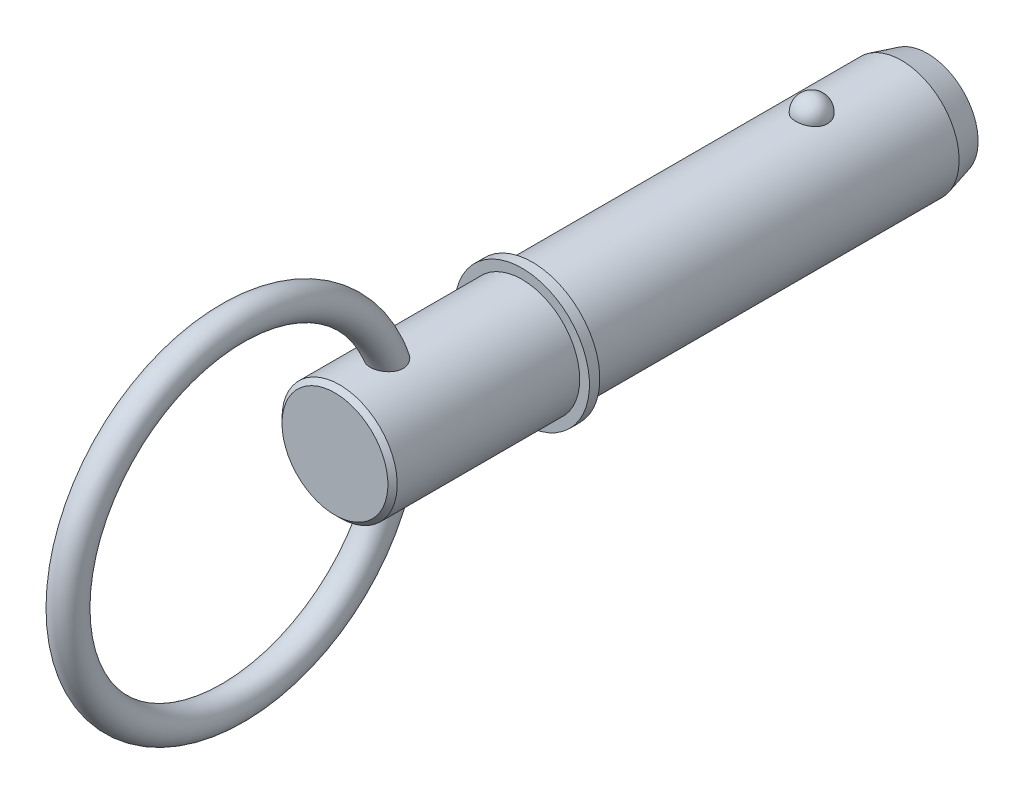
ISO-10303-21;
HEADER;
FILE_DESCRIPTION(('STEP AP214'),'2;1');
FILE_NAME('part.step','',(''),(''),'','','');
FILE_SCHEMA(('AUTOMOTIVE_DESIGN { 1 0 10303 214 1 1 1 1 }'));
ENDSEC;
DATA;
#1=APPLICATION_CONTEXT('core data for automotive mechanical design processes');
#2=APPLICATION_PROTOCOL_DEFINITION('international standard','automotive_design',2000,#1);
#3=PRODUCT_CONTEXT('',#1,'mechanical');
#4=PRODUCT('Part','Part','',(#3));
#5=PRODUCT_RELATED_PRODUCT_CATEGORY('part','',(#4));
#6=PRODUCT_DEFINITION_FORMATION('','',#4);
#7=PRODUCT_DEFINITION_CONTEXT('part definition',#1,'design');
#8=PRODUCT_DEFINITION('design','',#6,#7);
#9=PRODUCT_DEFINITION_SHAPE('','',#8);
#10=(LENGTH_UNIT() NAMED_UNIT(*) SI_UNIT(.MILLI.,.METRE.));
#11=(NAMED_UNIT(*) PLANE_ANGLE_UNIT() SI_UNIT($,.RADIAN.));
#12=(NAMED_UNIT(*) SI_UNIT($,.STERADIAN.) SOLID_ANGLE_UNIT());
#13=UNCERTAINTY_MEASURE_WITH_UNIT(LENGTH_MEASURE(1.E-05),#10,'distance_accuracy_value','');
#14=(GEOMETRIC_REPRESENTATION_CONTEXT(3) GLOBAL_UNCERTAINTY_ASSIGNED_CONTEXT((#13)) GLOBAL_UNIT_ASSIGNED_CONTEXT((#10,
#11,#12)) REPRESENTATION_CONTEXT('',''));
#15=CARTESIAN_POINT('',(0.,0.,0.));
#16=DIRECTION('',(0.,0.,1.));
#17=DIRECTION('',(1.,0.,0.));
#18=AXIS2_PLACEMENT_3D('',#15,#16,#17);
#19=CARTESIAN_POINT('',(0.,0.,50.8));
#20=DIRECTION('',(0.,0.,-1.));
#21=DIRECTION('',(-1.,0.,0.));
#22=AXIS2_PLACEMENT_3D('',#19,#20,#21);
#23=CYLINDRICAL_SURFACE('',#22,11.115);
#24=CARTESIAN_POINT('',(3.04058343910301,10.6910278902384,-3.07));
#25=CARTESIAN_POINT('',(3.04058039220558,10.6910304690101,-2.89837124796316));
#26=CARTESIAN_POINT('',(3.02657193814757,10.6950430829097,-2.72670368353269));
#27=CARTESIAN_POINT('',(2.97087341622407,10.7106465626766,-2.38822964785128));
#28=CARTESIAN_POINT('',(2.92917240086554,10.7222404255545,-2.22142512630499));
#29=CARTESIAN_POINT('',(2.81915317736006,10.751689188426,-1.89750816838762));
#30=CARTESIAN_POINT('',(2.75084669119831,10.7695413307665,-1.7403914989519));
#31=CARTESIAN_POINT('',(2.58932284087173,10.809510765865,-1.44013959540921));
#32=CARTESIAN_POINT('',(2.49610617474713,10.8316279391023,-1.29700396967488));
#33=CARTESIAN_POINT('',(2.28659317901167,10.877786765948,-1.02797591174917));
#34=CARTESIAN_POINT('',(2.17018825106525,10.9018371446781,-0.902169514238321));
#35=CARTESIAN_POINT('',(1.91759004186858,10.9490888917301,-0.672091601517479));
#36=CARTESIAN_POINT('',(1.78139672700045,10.9722902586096,-0.567820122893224));
#37=CARTESIAN_POINT('',(1.49327884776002,11.0151925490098,-0.383992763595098));
#38=CARTESIAN_POINT('',(1.34139928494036,11.034903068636,-0.304368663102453));
#39=CARTESIAN_POINT('',(1.02584823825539,11.0686948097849,-0.17173147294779));
#40=CARTESIAN_POINT('',(0.86217801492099,11.0827766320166,-0.118715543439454));
#41=CARTESIAN_POINT('',(0.530748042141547,11.1035404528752,-0.0415304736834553));
#42=CARTESIAN_POINT('',(0.363109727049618,11.1103474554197,-0.0168734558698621));
#43=CARTESIAN_POINT('',(0.0259327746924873,11.1162480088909,0.00453486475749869));
#44=CARTESIAN_POINT('',(-0.143605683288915,11.1153422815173,0.00128877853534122));
#45=CARTESIAN_POINT('',(-0.477280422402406,11.1059854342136,-0.0327676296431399));
#46=CARTESIAN_POINT('',(-0.641459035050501,11.0976393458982,-0.0631942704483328));
#47=CARTESIAN_POINT('',(-0.962236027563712,11.0744390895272,-0.150220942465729));
#48=CARTESIAN_POINT('',(-1.11883427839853,11.0595848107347,-0.206821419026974));
#49=CARTESIAN_POINT('',(-1.4210461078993,11.0248420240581,-0.34502889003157));
#50=CARTESIAN_POINT('',(-1.56659244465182,11.0049254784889,-0.426775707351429));
#51=CARTESIAN_POINT('',(-1.84189316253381,10.9622119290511,-0.612956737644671));
#52=CARTESIAN_POINT('',(-1.97164597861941,10.9394146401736,-0.717393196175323));
#53=CARTESIAN_POINT('',(-2.21432263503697,10.8929139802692,-0.948332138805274));
#54=CARTESIAN_POINT('',(-2.3268890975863,10.8692016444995,-1.07520847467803));
#55=CARTESIAN_POINT('',(-2.52940007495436,10.8238699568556,-1.34622145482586));
#56=CARTESIAN_POINT('',(-2.6193430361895,10.8022507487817,-1.49035928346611));
#57=CARTESIAN_POINT('',(-2.77523958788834,10.7632629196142,-1.79367507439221));
#58=CARTESIAN_POINT('',(-2.8409151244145,10.7459442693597,-1.95300253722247));
#59=CARTESIAN_POINT('',(-2.94519180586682,10.7178360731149,-2.28083009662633));
#60=CARTESIAN_POINT('',(-2.98379371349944,10.707046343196,-2.44932993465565));
#61=CARTESIAN_POINT('',(-3.03284665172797,10.6932559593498,-2.78998091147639));
#62=CARTESIAN_POINT('',(-3.04341313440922,10.6902233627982,-2.96211412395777));
#63=CARTESIAN_POINT('',(-3.03646037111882,10.6922002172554,-3.305762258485));
#64=CARTESIAN_POINT('',(-3.0189418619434,10.6972094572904,-3.47727719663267));
#65=CARTESIAN_POINT('',(-2.95641582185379,10.7146564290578,-3.81396465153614));
#66=CARTESIAN_POINT('',(-2.91154117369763,10.7270582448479,-3.97916375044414));
#67=CARTESIAN_POINT('',(-2.79553341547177,10.7578713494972,-4.29947360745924));
#68=CARTESIAN_POINT('',(-2.72439927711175,10.7762828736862,-4.45458397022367));
#69=CARTESIAN_POINT('',(-2.55718900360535,10.8171819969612,-4.75123550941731));
#70=CARTESIAN_POINT('',(-2.46098224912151,10.8396907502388,-4.89270014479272));
#71=CARTESIAN_POINT('',(-2.24623042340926,10.8862165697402,-5.15724095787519));
#72=CARTESIAN_POINT('',(-2.12768452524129,10.9102336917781,-5.28031645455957));
#73=CARTESIAN_POINT('',(-1.87085107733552,10.9571990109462,-5.5050961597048));
#74=CARTESIAN_POINT('',(-1.73249451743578,10.9801430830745,-5.60672245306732));
#75=CARTESIAN_POINT('',(-1.44010079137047,11.0223008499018,-5.78517789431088));
#76=CARTESIAN_POINT('',(-1.28606470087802,11.0415148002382,-5.86200874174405));
#77=CARTESIAN_POINT('',(-0.968615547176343,11.0738491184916,-5.98788441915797));
#78=CARTESIAN_POINT('',(-0.805339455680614,11.0870408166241,-6.03725610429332));
#79=CARTESIAN_POINT('',(-0.47244987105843,11.1062048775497,-6.10820004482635));
#80=CARTESIAN_POINT('',(-0.302837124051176,11.11217808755,-6.1297755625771));
#81=CARTESIAN_POINT('',(0.0345765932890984,11.1162034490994,-6.1443619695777));
#82=CARTESIAN_POINT('',(0.20235372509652,11.1143988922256,-6.13788957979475));
#83=CARTESIAN_POINT('',(0.534364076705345,11.103390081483,-6.09773981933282));
#84=CARTESIAN_POINT('',(0.698597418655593,11.094186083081,-6.06406338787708));
#85=CARTESIAN_POINT('',(1.01830314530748,11.0694136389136,-5.97063285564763));
#86=CARTESIAN_POINT('',(1.17380497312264,11.0538682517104,-5.91097318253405));
#87=CARTESIAN_POINT('',(1.472484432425,11.0180608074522,-5.76723645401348));
#88=CARTESIAN_POINT('',(1.6156613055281,10.9977984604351,-5.68315789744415));
#89=CARTESIAN_POINT('',(1.88801614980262,10.9543574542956,-5.49138807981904));
#90=CARTESIAN_POINT('',(2.01695079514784,10.9311394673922,-5.38336024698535));
#91=CARTESIAN_POINT('',(2.25501495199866,10.8845248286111,-5.14733839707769));
#92=CARTESIAN_POINT('',(2.36414099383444,10.8611281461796,-5.01934088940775));
#93=CARTESIAN_POINT('',(2.56152595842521,10.8162958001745,-4.74447932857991));
#94=CARTESIAN_POINT('',(2.64940088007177,10.7948999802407,-4.59733288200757));
#95=CARTESIAN_POINT('',(2.79961494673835,10.7569242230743,-4.29001203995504));
#96=CARTESIAN_POINT('',(2.86196390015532,10.7403424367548,-4.12984267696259));
#97=CARTESIAN_POINT('',(2.95377333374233,10.715429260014,-3.820623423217));
#98=CARTESIAN_POINT('',(2.98627018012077,10.7063495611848,-3.67252681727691));
#99=CARTESIAN_POINT('',(3.02967634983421,10.6941478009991,-3.37296350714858));
#100=CARTESIAN_POINT('',(3.04058612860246,10.6910256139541,-3.2214968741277));
#101=CARTESIAN_POINT('',(3.04058343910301,10.6910278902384,-3.07));
#102=B_SPLINE_CURVE_WITH_KNOTS('',3,(#24,#25,#26,#27,#28,#29,#30,#31,#32,#33,#34,#35,#36,#37,
#38,#39,#40,#41,#42,#43,#44,#45,#46,#47,#48,#49,#50,#51,#52,#53,#54,#55,#56,#57,#58,#59,#60,#61,
#62,#63,#64,#65,#66,#67,#68,#69,#70,#71,#72,#73,#74,#75,#76,#77,#78,#79,#80,#81,#82,#83,#84,#85,
#86,#87,#88,#89,#90,#91,#92,#93,#94,#95,#96,#97,#98,#99,#100,#101),.UNSPECIFIED.,.T.,.F.,(4,2,2,
2,2,2,2,2,2,2,2,2,2,2,2,2,2,2,2,2,2,2,2,2,2,2,2,2,2,2,2,2,2,2,2,2,2,2,4),(0.,0.514341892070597,
1.02888723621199,1.54320613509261,2.0575106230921,2.57428293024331,3.09105611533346,
3.60638589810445,4.1216606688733,4.62793159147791,5.1341551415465,5.63334381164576,
6.13254097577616,6.63456562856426,7.13663998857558,7.64804063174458,8.15947638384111,
8.6766026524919,9.19371435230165,9.70869321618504,10.223658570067,10.7361421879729,
11.2486458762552,11.7638748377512,12.2791228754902,12.7962115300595,13.3132647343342,
13.8240238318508,14.3347229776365,14.8360540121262,15.3373677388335,15.8368746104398,
16.3364121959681,16.8434736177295,17.3506237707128,17.8663484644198,18.3818748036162,
18.8358944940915,19.2899046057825),.UNSPECIFIED.);
#103=CARTESIAN_POINT('',(3.04058343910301,10.6910278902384,-3.07));
#104=VERTEX_POINT('',#103);
#105=EDGE_CURVE('E103',#104,#104,#102,.T.);
#106=ORIENTED_EDGE('',*,*,#105,.T.);
#107=EDGE_LOOP('',(#106));
#108=FACE_BOUND('',#107,.T.);
#109=CARTESIAN_POINT('',(0.,0.,-20.3999999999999));
#110=DIRECTION('',(0.,0.,-1.));
#111=DIRECTION('',(-1.,0.,0.));
#112=AXIS2_PLACEMENT_3D('',#109,#110,#111);
#113=CIRCLE('',#112,11.115);
#114=CARTESIAN_POINT('',(-11.115,0.,-20.3999999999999));
#115=VERTEX_POINT('',#114);
#116=EDGE_CURVE('E111',#115,#115,#113,.F.);
#117=ORIENTED_EDGE('',*,*,#116,.T.);
#118=EDGE_LOOP('',(#117));
#119=FACE_BOUND('',#118,.T.);
#120=CARTESIAN_POINT('',(0.,0.,50.8));
#121=DIRECTION('',(0.,0.,1.));
#122=DIRECTION('',(1.,0.,0.));
#123=AXIS2_PLACEMENT_3D('',#120,#121,#122);
#124=CIRCLE('',#123,11.115);
#125=CARTESIAN_POINT('',(11.115,0.,50.8));
#126=VERTEX_POINT('',#125);
#127=EDGE_CURVE('E109',#126,#126,#124,.T.);
#128=ORIENTED_EDGE('',*,*,#127,.F.);
#129=EDGE_LOOP('',(#128));
#130=FACE_BOUND('',#129,.T.);
#131=ADVANCED_FACE('F39',(#108,#119,#130),#23,.T.);
#132=CARTESIAN_POINT('',(0.,0.,-25.4));
#133=DIRECTION('',(0.,0.,-1.));
#134=DIRECTION('',(-1.,0.,0.));
#135=AXIS2_PLACEMENT_3D('',#132,#133,#134);
#136=PLANE('',#135);
#137=CARTESIAN_POINT('',(0.,0.,-25.4));
#138=DIRECTION('',(0.,0.,-1.));
#139=DIRECTION('',(-1.,0.,0.));
#140=AXIS2_PLACEMENT_3D('',#137,#138,#139);
#141=CIRCLE('',#140,9.77525403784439);
#142=CARTESIAN_POINT('',(-9.77525403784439,0.,-25.4));
#143=VERTEX_POINT('',#142);
#144=EDGE_CURVE('E142',#143,#143,#141,.T.);
#145=ORIENTED_EDGE('',*,*,#144,.T.);
#146=EDGE_LOOP('',(#145));
#147=FACE_BOUND('',#146,.T.);
#148=ADVANCED_FACE('F89',(#147),#136,.T.);
#149=CARTESIAN_POINT('',(0.,0.,-25.4));
#150=DIRECTION('',(0.,0.,1.));
#151=DIRECTION('',(1.,0.,0.));
#152=AXIS2_PLACEMENT_3D('',#149,#150,#151);
#153=CONICAL_SURFACE('',#152,9.77525403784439,0.261799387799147);
#154=ORIENTED_EDGE('',*,*,#116,.F.);
#155=EDGE_LOOP('',(#154));
#156=FACE_BOUND('',#155,.T.);
#157=ORIENTED_EDGE('',*,*,#144,.F.);
#158=EDGE_LOOP('',(#157));
#159=FACE_BOUND('',#158,.T.);
#160=ADVANCED_FACE('F95',(#156,#159),#153,.T.);
#161=CARTESIAN_POINT('',(0.,11.115,-3.07));
#162=DIRECTION('',(0.,1.,0.));
#163=DIRECTION('',(0.,0.,1.));
#164=AXIS2_PLACEMENT_3D('',#161,#162,#163);
#165=SPHERICAL_SURFACE('',#164,3.07);
#166=ORIENTED_EDGE('',*,*,#105,.F.);
#167=EDGE_LOOP('',(#166));
#168=FACE_BOUND('',#167,.T.);
#169=ADVANCED_FACE('F114',(#168),#165,.T.);
#170=CARTESIAN_POINT('',(0.,0.,50.8));
#171=DIRECTION('',(0.,0.,-1.));
#172=DIRECTION('',(-1.,0.,0.));
#173=AXIS2_PLACEMENT_3D('',#170,#171,#172);
#174=PLANE('',#173);
#175=ORIENTED_EDGE('',*,*,#127,.T.);
#176=EDGE_LOOP('',(#175));
#177=FACE_BOUND('',#176,.T.);
#178=CARTESIAN_POINT('',(0.,0.,50.8));
#179=DIRECTION('',(0.,0.,-1.));
#180=DIRECTION('',(-1.,0.,0.));
#181=AXIS2_PLACEMENT_3D('',#178,#179,#180);
#182=CIRCLE('',#181,13.);
#183=CARTESIAN_POINT('',(-13.,0.,50.8));
#184=VERTEX_POINT('',#183);
#185=EDGE_CURVE('E110',#184,#184,#182,.T.);
#186=ORIENTED_EDGE('',*,*,#185,.T.);
#187=EDGE_LOOP('',(#186));
#188=FACE_BOUND('',#187,.T.);
#189=ADVANCED_FACE('F118',(#177,#188),#174,.T.);
#190=CARTESIAN_POINT('',(0.,0.,33.7287874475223));
#191=DIRECTION('',(0.,0.,-1.));
#192=DIRECTION('',(-1.,0.,0.));
#193=AXIS2_PLACEMENT_3D('',#190,#191,#192);
#194=CYLINDRICAL_SURFACE('',#193,13.);
#195=CARTESIAN_POINT('',(0.,0.,52.8));
#196=DIRECTION('',(0.,0.,-1.));
#197=DIRECTION('',(-1.,0.,0.));
#198=AXIS2_PLACEMENT_3D('',#195,#196,#197);
#199=CIRCLE('',#198,13.);
#200=CARTESIAN_POINT('',(-13.,0.,52.8));
#201=VERTEX_POINT('',#200);
#202=EDGE_CURVE('E135',#201,#201,#199,.T.);
#203=ORIENTED_EDGE('',*,*,#202,.T.);
#204=EDGE_LOOP('',(#203));
#205=FACE_BOUND('',#204,.T.);
#206=ORIENTED_EDGE('',*,*,#185,.F.);
#207=EDGE_LOOP('',(#206));
#208=FACE_BOUND('',#207,.T.);
#209=ADVANCED_FACE('F122',(#205,#208),#194,.T.);
#210=CARTESIAN_POINT('',(0.,13.,52.8));
#211=DIRECTION('',(0.,0.,1.));
#212=DIRECTION('',(1.,0.,0.));
#213=AXIS2_PLACEMENT_3D('',#210,#211,#212);
#214=PLANE('',#213);
#215=CARTESIAN_POINT('',(0.,0.,52.8));
#216=DIRECTION('',(0.,0.,1.));
#217=DIRECTION('',(1.,0.,0.));
#218=AXIS2_PLACEMENT_3D('',#215,#216,#217);
#219=CIRCLE('',#218,11.115);
#220=CARTESIAN_POINT('',(11.115,0.,52.8));
#221=VERTEX_POINT('',#220);
#222=EDGE_CURVE('E113',#221,#221,#219,.T.);
#223=ORIENTED_EDGE('',*,*,#222,.F.);
#224=EDGE_LOOP('',(#223));
#225=FACE_BOUND('',#224,.T.);
#226=ORIENTED_EDGE('',*,*,#202,.F.);
#227=EDGE_LOOP('',(#226));
#228=FACE_BOUND('',#227,.T.);
#229=ADVANCED_FACE('F86',(#225,#228),#214,.T.);
#230=CARTESIAN_POINT('',(0.,0.,88.9));
#231=DIRECTION('',(0.,0.,-1.));
#232=DIRECTION('',(-1.,0.,0.));
#233=AXIS2_PLACEMENT_3D('',#230,#231,#232);
#234=CYLINDRICAL_SURFACE('',#233,11.115);
#235=CARTESIAN_POINT('',(-1.22435852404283,-11.0473603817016,75.9784197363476));
#236=CARTESIAN_POINT('',(-1.07078016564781,-11.0643805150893,75.9116991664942));
#237=CARTESIAN_POINT('',(-0.911372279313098,-11.0787777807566,75.8577454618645));
#238=CARTESIAN_POINT('',(-0.585451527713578,-11.1007717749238,75.7765522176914));
#239=CARTESIAN_POINT('',(-0.418938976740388,-11.1083688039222,75.7493114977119));
#240=CARTESIAN_POINT('',(-0.0835394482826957,-11.1159515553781,75.7221212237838));
#241=CARTESIAN_POINT('',(0.085347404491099,-11.1159376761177,75.7221702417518));
#242=CARTESIAN_POINT('',(0.420723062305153,-11.1083011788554,75.7495547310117));
#243=CARTESIAN_POINT('',(0.587211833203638,-11.1006784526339,75.7768905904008));
#244=CARTESIAN_POINT('',(0.91318995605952,-11.0786293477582,75.8582995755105));
#245=CARTESIAN_POINT('',(1.07267378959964,-11.0641977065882,75.9123933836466));
#246=CARTESIAN_POINT('',(1.37994044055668,-11.0300907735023,76.0461408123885));
#247=CARTESIAN_POINT('',(1.52772335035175,-11.0104155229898,76.1257942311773));
#248=CARTESIAN_POINT('',(1.80679367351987,-10.9680716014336,76.3084678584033));
#249=CARTESIAN_POINT('',(1.93814041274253,-10.945414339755,76.4114000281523));
#250=CARTESIAN_POINT('',(2.18117403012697,-10.8995884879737,76.638212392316));
#251=CARTESIAN_POINT('',(2.29286356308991,-10.8764199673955,76.7620897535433));
#252=CARTESIAN_POINT('',(2.49238969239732,-10.8324319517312,77.0259926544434));
#253=CARTESIAN_POINT('',(2.58046870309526,-10.8115899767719,77.1658312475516));
#254=CARTESIAN_POINT('',(2.73218762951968,-10.7742522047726,77.4586913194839));
#255=CARTESIAN_POINT('',(2.7958294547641,-10.757756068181,77.6117117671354));
#256=CARTESIAN_POINT('',(2.89767977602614,-10.7307723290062,77.9266092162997));
#257=CARTESIAN_POINT('',(2.93586554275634,-10.7202900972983,78.0884939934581));
#258=CARTESIAN_POINT('',(2.98678800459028,-10.7062139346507,78.4164805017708));
#259=CARTESIAN_POINT('',(2.99951894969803,-10.7026215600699,78.5825831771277));
#260=CARTESIAN_POINT('',(3.0004780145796,-10.7023530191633,78.9232270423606));
#261=CARTESIAN_POINT('',(2.98743421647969,-10.7060358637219,79.0977701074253));
#262=CARTESIAN_POINT('',(2.93592917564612,-10.7202719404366,79.4427508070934));
#263=CARTESIAN_POINT('',(2.8974582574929,-10.7308277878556,79.6131868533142));
#264=CARTESIAN_POINT('',(2.79180512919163,-10.7588257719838,79.9631149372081));
#265=CARTESIAN_POINT('',(2.72213928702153,-10.776850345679,80.1418115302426));
#266=CARTESIAN_POINT('',(2.55612841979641,-10.8174264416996,80.4859744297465));
#267=CARTESIAN_POINT('',(2.45975697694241,-10.8399824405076,80.6514274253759));
#268=CARTESIAN_POINT('',(2.23434632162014,-10.8887625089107,80.975672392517));
#269=CARTESIAN_POINT('',(2.10349593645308,-10.9151327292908,81.1331925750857));
#270=CARTESIAN_POINT('',(1.81505097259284,-10.96677510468,81.4216682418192));
#271=CARTESIAN_POINT('',(1.65749731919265,-10.9920488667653,81.5526637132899));
#272=CARTESIAN_POINT('',(1.36197799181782,-11.0319737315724,81.7513134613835));
#273=CARTESIAN_POINT('',(1.22927684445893,-11.0476896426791,81.8266009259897));
#274=CARTESIAN_POINT('',(0.952979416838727,-11.0749380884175,81.9545744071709));
#275=CARTESIAN_POINT('',(0.809393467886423,-11.0864745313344,82.0072815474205));
#276=CARTESIAN_POINT('',(0.513954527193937,-11.1041011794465,82.0870588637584));
#277=CARTESIAN_POINT('',(0.362058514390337,-11.1101594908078,82.1139789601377));
#278=CARTESIAN_POINT('',(0.0557792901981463,-11.1159132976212,82.1395595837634));
#279=CARTESIAN_POINT('',(-0.0986030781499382,-11.1156109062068,82.1382294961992));
#280=CARTESIAN_POINT('',(-0.389768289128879,-11.1090283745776,82.1089352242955));
#281=CARTESIAN_POINT('',(-0.526830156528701,-11.1033186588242,82.0835124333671));
#282=CARTESIAN_POINT('',(-0.794878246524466,-11.0873547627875,82.0112701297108));
#283=CARTESIAN_POINT('',(-0.925863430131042,-11.0770998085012,81.9644469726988));
#284=CARTESIAN_POINT('',(-1.18354406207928,-11.0525934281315,81.8498438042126));
#285=CARTESIAN_POINT('',(-1.30991621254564,-11.0382116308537,81.7813711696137));
#286=CARTESIAN_POINT('',(-1.55122352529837,-11.0068962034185,81.6271312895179));
#287=CARTESIAN_POINT('',(-1.66615377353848,-10.9899614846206,81.5413566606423));
#288=CARTESIAN_POINT('',(-1.90024050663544,-10.9520991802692,81.3408720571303));
#289=CARTESIAN_POINT('',(-2.01728342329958,-10.9309598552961,81.2237372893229));
#290=CARTESIAN_POINT('',(-2.23333659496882,-10.8888735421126,80.9738397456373));
#291=CARTESIAN_POINT('',(-2.33233396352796,-10.8679267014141,80.8410659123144));
#292=CARTESIAN_POINT('',(-2.52607041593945,-10.8246766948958,80.5400006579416));
#293=CARTESIAN_POINT('',(-2.61741570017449,-10.8027194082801,80.3694627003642));
#294=CARTESIAN_POINT('',(-2.77251687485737,-10.7639568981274,80.0156715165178));
#295=CARTESIAN_POINT('',(-2.8362578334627,-10.7471544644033,79.8324114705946));
#296=CARTESIAN_POINT('',(-2.93668505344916,-10.7201706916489,79.4466242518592));
#297=CARTESIAN_POINT('',(-2.97161961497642,-10.7104219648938,79.243594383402));
#298=CARTESIAN_POINT('',(-2.99683495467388,-10.7033740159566,78.9368749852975));
#299=CARTESIAN_POINT('',(-3.00070536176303,-10.7022882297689,78.8342341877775));
#300=CARTESIAN_POINT('',(-2.99908594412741,-10.7027439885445,78.6290499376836));
#301=CARTESIAN_POINT('',(-2.99360154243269,-10.7042840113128,78.5265064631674));
#302=CARTESIAN_POINT('',(-2.97382504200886,-10.7097936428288,78.330330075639));
#303=CARTESIAN_POINT('',(-2.9602439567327,-10.7135669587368,78.2366192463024));
#304=CARTESIAN_POINT('',(-2.92480741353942,-10.723295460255,78.050932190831));
#305=CARTESIAN_POINT('',(-2.90295619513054,-10.7292495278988,77.9589551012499));
#306=CARTESIAN_POINT('',(-2.8509700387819,-10.7431800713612,77.7775474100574));
#307=CARTESIAN_POINT('',(-2.82083748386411,-10.7511559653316,77.6881160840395));
#308=CARTESIAN_POINT('',(-2.75241691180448,-10.7688750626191,77.5126453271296));
#309=CARTESIAN_POINT('',(-2.71412954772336,-10.7786181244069,77.4266056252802));
#310=CARTESIAN_POINT('',(-2.59550576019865,-10.807996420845,77.1910554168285));
#311=CARTESIAN_POINT('',(-2.50612224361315,-10.8292837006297,77.0461731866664));
#312=CARTESIAN_POINT('',(-2.30366035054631,-10.8741467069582,76.7745713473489));
#313=CARTESIAN_POINT('',(-2.19058370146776,-10.8977222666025,76.6478504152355));
#314=CARTESIAN_POINT('',(-1.94442412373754,-10.9443154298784,76.4164621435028));
#315=CARTESIAN_POINT('',(-1.81141354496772,-10.967334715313,76.3117182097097));
#316=CARTESIAN_POINT('',(-1.529042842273,-11.0102504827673,76.1264358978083));
#317=CARTESIAN_POINT('',(-1.37968206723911,-11.0301468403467,76.0458984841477));
#318=CARTESIAN_POINT('',(-1.22435852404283,-11.0473603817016,75.9784197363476));
#319=B_SPLINE_CURVE_WITH_KNOTS('',3,(#235,#236,#237,#238,#239,#240,#241,#242,#243,#244,#245,
#246,#247,#248,#249,#250,#251,#252,#253,#254,#255,#256,#257,#258,#259,#260,#261,#262,#263,#264,
#265,#266,#267,#268,#269,#270,#271,#272,#273,#274,#275,#276,#277,#278,#279,#280,#281,#282,#283,
#284,#285,#286,#287,#288,#289,#290,#291,#292,#293,#294,#295,#296,#297,#298,#299,#300,#301,#302,
#303,#304,#305,#306,#307,#308,#309,#310,#311,#312,#313,#314,#315,#316,#317,#318),.UNSPECIFIED.,
.T.,.F.,(4,2,2,2,2,2,2,2,2,2,2,2,2,2,2,2,2,2,2,2,2,2,2,2,2,2,2,2,2,2,2,2,2,2,2,2,2,2,2,2,2,4),
(0.,0.504317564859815,1.00861284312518,1.51288173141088,2.01715779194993,2.52182424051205,
3.02648670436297,3.52927157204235,4.03198848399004,4.52932690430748,5.02662645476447,
5.5243694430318,6.0222248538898,6.545261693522,7.06849767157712,7.64398785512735,
8.22004937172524,8.83633461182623,9.45168373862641,9.90997173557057,10.3678300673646,
10.8283372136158,11.2886913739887,11.7053264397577,12.1220324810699,12.5537129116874,
12.9855779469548,13.4844842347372,13.9837454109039,14.5653303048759,15.1472294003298,
15.762338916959,16.0701226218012,16.3777279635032,16.6616380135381,16.9454027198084,
17.229085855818,17.5127462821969,18.0246262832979,18.5364689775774,19.0464970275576,
19.5565453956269),.UNSPECIFIED.);
#320=CARTESIAN_POINT('',(-1.22435852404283,-11.0473603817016,75.9784197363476));
#321=VERTEX_POINT('',#320);
#322=EDGE_CURVE('E10',#321,#321,#319,.T.);
#323=ORIENTED_EDGE('',*,*,#322,.F.);
#324=EDGE_LOOP('',(#323));
#325=FACE_BOUND('',#324,.T.);
#326=CARTESIAN_POINT('',(-1.22435852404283,11.0473603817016,75.9784197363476));
#327=CARTESIAN_POINT('',(-1.37630771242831,11.0305212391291,76.044431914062));
#328=CARTESIAN_POINT('',(-1.52254325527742,11.0111158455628,76.1229381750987));
#329=CARTESIAN_POINT('',(-1.79945383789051,10.9692671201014,76.3031533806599));
#330=CARTESIAN_POINT('',(-1.93013010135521,10.9468240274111,76.4048604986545));
#331=CARTESIAN_POINT('',(-2.17227655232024,10.9013603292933,76.6290359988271));
#332=CARTESIAN_POINT('',(-2.28373752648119,10.8783394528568,76.7515142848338));
#333=CARTESIAN_POINT('',(-2.4842745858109,10.8343057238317,77.0138954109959));
#334=CARTESIAN_POINT('',(-2.57335330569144,10.8132926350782,77.1537961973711));
#335=CARTESIAN_POINT('',(-2.7264007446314,10.7757209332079,77.4459648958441));
#336=CARTESIAN_POINT('',(-2.79054231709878,10.7591319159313,77.5981385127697));
#337=CARTESIAN_POINT('',(-2.89354234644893,10.7318913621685,77.9112862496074));
#338=CARTESIAN_POINT('',(-2.93239912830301,10.7212402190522,78.0722609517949));
#339=CARTESIAN_POINT('',(-2.98540436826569,10.7066038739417,78.4019559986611));
#340=CARTESIAN_POINT('',(-2.9990165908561,10.7027634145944,78.5707680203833));
#341=CARTESIAN_POINT('',(-3.0008814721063,10.7022388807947,78.9085087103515));
#342=CARTESIAN_POINT('',(-2.98912652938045,10.7055569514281,79.0774373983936));
#343=CARTESIAN_POINT('',(-2.93985175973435,10.7191979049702,79.4248560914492));
#344=CARTESIAN_POINT('',(-2.90036626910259,10.7300544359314,79.6030445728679));
#345=CARTESIAN_POINT('',(-2.7955500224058,10.7578360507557,79.9512150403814));
#346=CARTESIAN_POINT('',(-2.73019988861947,10.774765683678,80.1211907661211));
#347=CARTESIAN_POINT('',(-2.56762574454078,10.8147227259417,80.4657841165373));
#348=CARTESIAN_POINT('',(-2.46786230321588,10.838191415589,80.6391574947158));
#349=CARTESIAN_POINT('',(-2.24100420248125,10.8873575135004,80.9666868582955));
#350=CARTESIAN_POINT('',(-2.11391925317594,10.9130541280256,81.1208496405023));
#351=CARTESIAN_POINT('',(-1.85542700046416,10.9597063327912,81.3827355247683));
#352=CARTESIAN_POINT('',(-1.72758345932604,10.9807909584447,81.4939559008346));
#353=CARTESIAN_POINT('',(-1.45489931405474,11.0202250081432,81.6941223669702));
#354=CARTESIAN_POINT('',(-1.31006770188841,11.0385758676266,81.7830801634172));
#355=CARTESIAN_POINT('',(-1.08171164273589,11.0625084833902,81.8963702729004));
#356=CARTESIAN_POINT('',(-1.00332234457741,11.069914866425,81.9308967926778));
#357=CARTESIAN_POINT('',(-0.843525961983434,11.0832350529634,81.9923914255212));
#358=CARTESIAN_POINT('',(-0.762120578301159,11.0891496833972,82.0193637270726));
#359=CARTESIAN_POINT('',(-0.5970144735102,11.0992628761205,82.0651819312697));
#360=CARTESIAN_POINT('',(-0.513315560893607,11.1034627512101,82.0840340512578));
#361=CARTESIAN_POINT('',(-0.344374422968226,11.1099851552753,82.1132096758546));
#362=CARTESIAN_POINT('',(-0.259132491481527,11.1123080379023,82.1235347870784));
#363=CARTESIAN_POINT('',(-0.100838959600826,11.114780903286,82.1345196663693));
#364=CARTESIAN_POINT('',(-0.0278735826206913,11.1152042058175,82.136395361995));
#365=CARTESIAN_POINT('',(0.117962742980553,11.1146132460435,82.1337734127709));
#366=CARTESIAN_POINT('',(0.190833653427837,11.1135985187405,82.1292737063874));
#367=CARTESIAN_POINT('',(0.335842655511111,11.110161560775,82.1139786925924));
#368=CARTESIAN_POINT('',(0.407981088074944,11.1077400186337,82.1031864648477));
#369=CARTESIAN_POINT('',(0.551029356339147,11.1015643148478,82.075503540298));
#370=CARTESIAN_POINT('',(0.621938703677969,11.0978096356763,82.0586104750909));
#371=CARTESIAN_POINT('',(0.825381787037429,11.0851145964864,82.0010547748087));
#372=CARTESIAN_POINT('',(0.955713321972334,11.0745538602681,81.9527059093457));
#373=CARTESIAN_POINT('',(1.20733127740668,11.0499605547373,81.8373252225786));
#374=CARTESIAN_POINT('',(1.328615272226,11.0359270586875,81.7702884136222));
#375=CARTESIAN_POINT('',(1.57344360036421,11.0038352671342,81.6118439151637));
#376=CARTESIAN_POINT('',(1.69572941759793,10.9855025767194,81.5185512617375));
#377=CARTESIAN_POINT('',(1.92565215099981,10.9475431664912,81.3156505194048));
#378=CARTESIAN_POINT('',(2.03328016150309,10.9279156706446,81.2060325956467));
#379=CARTESIAN_POINT('',(2.25048911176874,10.8854412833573,80.9529911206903));
#380=CARTESIAN_POINT('',(2.35710396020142,10.8626332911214,80.8070101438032));
#381=CARTESIAN_POINT('',(2.54757318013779,10.8195493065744,80.500478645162));
#382=CARTESIAN_POINT('',(2.63141052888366,10.799275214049,80.3399173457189));
#383=CARTESIAN_POINT('',(2.78342312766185,10.7611645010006,79.9878272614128));
#384=CARTESIAN_POINT('',(2.84851472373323,10.7439117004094,79.7948938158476));
#385=CARTESIAN_POINT('',(2.9456265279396,10.7177011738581,79.4001309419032));
#386=CARTESIAN_POINT('',(2.97764942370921,10.7087427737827,79.1983022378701));
#387=CARTESIAN_POINT('',(2.99864828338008,10.7028651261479,78.8959897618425));
#388=CARTESIAN_POINT('',(3.00125529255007,10.7021342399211,78.7963789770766));
#389=CARTESIAN_POINT('',(2.9976304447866,10.7031517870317,78.5973450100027));
#390=CARTESIAN_POINT('',(2.99140295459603,10.704898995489,78.4979217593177));
#391=CARTESIAN_POINT('',(2.96990080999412,10.710883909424,78.3001790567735));
#392=CARTESIAN_POINT('',(2.95463019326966,10.7151205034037,78.2018591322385));
#393=CARTESIAN_POINT('',(2.91493260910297,10.7259879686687,78.0072196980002));
#394=CARTESIAN_POINT('',(2.89050674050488,10.7326185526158,77.9108999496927));
#395=CARTESIAN_POINT('',(2.83556656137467,10.7472556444,77.7312221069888));
#396=CARTESIAN_POINT('',(2.8059633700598,10.7550439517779,77.6475666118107));
#397=CARTESIAN_POINT('',(2.73953102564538,10.7721572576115,77.4833000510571));
#398=CARTESIAN_POINT('',(2.70269935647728,10.7814827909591,77.4026900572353));
#399=CARTESIAN_POINT('',(2.62203440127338,10.801383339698,77.2452733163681));
#400=CARTESIAN_POINT('',(2.57820565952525,10.8119575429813,77.1684641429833));
#401=CARTESIAN_POINT('',(2.48382482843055,10.8340293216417,77.0192237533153));
#402=CARTESIAN_POINT('',(2.43327032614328,10.8455272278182,76.9467941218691));
#403=CARTESIAN_POINT('',(2.27895739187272,10.879345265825,76.7459926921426));
#404=CARTESIAN_POINT('',(2.1671718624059,10.9023791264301,76.6237643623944));
#405=CARTESIAN_POINT('',(1.92442677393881,10.9478318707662,76.4001515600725));
#406=CARTESIAN_POINT('',(1.79346836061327,10.9702507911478,76.298765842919));
#407=CARTESIAN_POINT('',(1.51657151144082,11.0119360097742,76.1195646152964));
#408=CARTESIAN_POINT('',(1.37069187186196,11.0312139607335,76.0416610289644));
#409=CARTESIAN_POINT('',(1.06764402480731,11.0646548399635,75.9106801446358));
#410=CARTESIAN_POINT('',(0.910475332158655,11.0788175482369,75.8576039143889));
#411=CARTESIAN_POINT('',(0.587492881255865,11.1006548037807,75.77697871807));
#412=CARTESIAN_POINT('',(0.421604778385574,11.1082585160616,75.7497081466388));
#413=CARTESIAN_POINT('',(0.0874262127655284,11.1159127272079,75.7222592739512));
#414=CARTESIAN_POINT('',(-0.0808643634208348,11.1159628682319,75.7220822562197));
#415=CARTESIAN_POINT('',(-0.416252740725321,11.1084780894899,75.7489180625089));
#416=CARTESIAN_POINT('',(-0.583334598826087,11.1008914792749,75.776116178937));
#417=CARTESIAN_POINT('',(-0.910355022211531,11.0788693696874,75.8574015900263));
#418=CARTESIAN_POINT('',(-1.07029370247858,11.064433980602,75.9114884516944));
#419=CARTESIAN_POINT('',(-1.22435852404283,11.0473603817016,75.9784197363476));
#420=B_SPLINE_CURVE_WITH_KNOTS('',3,(#326,#327,#328,#329,#330,#331,#332,#333,#334,#335,#336,
#337,#338,#339,#340,#341,#342,#343,#344,#345,#346,#347,#348,#349,#350,#351,#352,#353,#354,#355,
#356,#357,#358,#359,#360,#361,#362,#363,#364,#365,#366,#367,#368,#369,#370,#371,#372,#373,#374,
#375,#376,#377,#378,#379,#380,#381,#382,#383,#384,#385,#386,#387,#388,#389,#390,#391,#392,#393,
#394,#395,#396,#397,#398,#399,#400,#401,#402,#403,#404,#405,#406,#407,#408,#409,#410,#411,#412,
#413,#414,#415,#416,#417,#418,#419),.UNSPECIFIED.,.T.,.F.,(4,2,2,2,2,2,2,2,2,2,2,2,2,2,2,2,2,2,
2,2,2,2,2,2,2,2,2,2,2,2,2,2,2,2,2,2,2,2,2,2,2,2,2,2,2,2,4),(0.,0.498977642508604,
0.997916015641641,1.49709295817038,1.99621111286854,2.49180514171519,2.98743199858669,
3.49347125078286,3.99966216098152,4.54591839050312,5.09258465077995,5.69407889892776,
6.29535972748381,6.80565832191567,7.31568801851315,7.57328514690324,7.83073916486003,
8.08799570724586,8.34520376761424,8.5638916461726,8.78265025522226,9.00130188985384,
9.22003849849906,9.63638938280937,10.0528514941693,10.5157946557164,10.9790178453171,
11.5234572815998,12.0683024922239,12.6784825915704,13.288613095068,13.5872082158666,
13.8856557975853,14.1839702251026,14.482248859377,14.7491407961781,15.016125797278,
15.2829381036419,15.5498463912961,16.0489312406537,16.5479862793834,17.0451454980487,
17.542326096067,18.0448111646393,18.5473200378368,19.0532532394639,19.5591782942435),.UNSPECIFIED.);
#421=CARTESIAN_POINT('',(-1.22435852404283,11.0473603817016,75.9784197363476));
#422=VERTEX_POINT('',#421);
#423=EDGE_CURVE('E51',#422,#422,#420,.T.);
#424=ORIENTED_EDGE('',*,*,#423,.F.);
#425=EDGE_LOOP('',(#424));
#426=FACE_BOUND('',#425,.T.);
#427=CARTESIAN_POINT('',(0.,0.,88.));
#428=DIRECTION('',(0.,0.,-1.));
#429=DIRECTION('',(-1.,0.,0.));
#430=AXIS2_PLACEMENT_3D('',#427,#428,#429);
#431=CIRCLE('',#430,11.115);
#432=CARTESIAN_POINT('',(-11.115,0.,88.));
#433=VERTEX_POINT('',#432);
#434=EDGE_CURVE('E65',#433,#433,#431,.T.);
#435=ORIENTED_EDGE('',*,*,#434,.T.);
#436=EDGE_LOOP('',(#435));
#437=FACE_BOUND('',#436,.T.);
#438=ORIENTED_EDGE('',*,*,#222,.T.);
#439=EDGE_LOOP('',(#438));
#440=FACE_BOUND('',#439,.T.);
#441=ADVANCED_FACE('F70',(#325,#426,#437,#440),#234,.T.);
#442=CARTESIAN_POINT('',(0.,0.,88.9));
#443=DIRECTION('',(0.,0.,-1.));
#444=DIRECTION('',(-1.,0.,0.));
#445=AXIS2_PLACEMENT_3D('',#442,#443,#444);
#446=PLANE('',#445);
#447=CARTESIAN_POINT('',(0.,0.,88.9));
#448=DIRECTION('',(0.,0.,-1.));
#449=DIRECTION('',(-1.,0.,0.));
#450=AXIS2_PLACEMENT_3D('',#447,#448,#449);
#451=CIRCLE('',#450,10.215);
#452=CARTESIAN_POINT('',(-10.215,0.,88.9));
#453=VERTEX_POINT('',#452);
#454=EDGE_CURVE('E58',#453,#453,#451,.F.);
#455=ORIENTED_EDGE('',*,*,#454,.T.);
#456=EDGE_LOOP('',(#455));
#457=FACE_BOUND('',#456,.T.);
#458=ADVANCED_FACE('F77',(#457),#446,.F.);
#459=CARTESIAN_POINT('',(0.,0.,88.));
#460=DIRECTION('',(0.,0.,-1.));
#461=DIRECTION('',(-1.,0.,0.));
#462=AXIS2_PLACEMENT_3D('',#459,#460,#461);
#463=CONICAL_SURFACE('',#462,11.115,0.785398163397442);
#464=CARTESIAN_POINT('',(-10.215,0.,88.9));
#465=CARTESIAN_POINT('',(-10.224375,0.,88.890625));
#466=CARTESIAN_POINT('',(-10.23375,0.,88.88125));
#467=CARTESIAN_POINT('',(-10.2525,0.,88.8625));
#468=CARTESIAN_POINT('',(-10.261875,0.,88.853125));
#469=CARTESIAN_POINT('',(-10.280625,0.,88.834375));
#470=CARTESIAN_POINT('',(-10.29,0.,88.825));
#471=CARTESIAN_POINT('',(-10.30875,0.,88.80625));
#472=CARTESIAN_POINT('',(-10.318125,0.,88.796875));
#473=CARTESIAN_POINT('',(-10.336875,0.,88.778125));
#474=CARTESIAN_POINT('',(-10.34625,0.,88.76875));
#475=CARTESIAN_POINT('',(-10.365,0.,88.75));
#476=CARTESIAN_POINT('',(-10.374375,0.,88.740625));
#477=CARTESIAN_POINT('',(-10.393125,0.,88.721875));
#478=CARTESIAN_POINT('',(-10.4025,0.,88.7125));
#479=CARTESIAN_POINT('',(-10.42125,0.,88.69375));
#480=CARTESIAN_POINT('',(-10.430625,0.,88.684375));
#481=CARTESIAN_POINT('',(-10.449375,0.,88.665625));
#482=CARTESIAN_POINT('',(-10.45875,0.,88.65625));
#483=CARTESIAN_POINT('',(-10.4775,0.,88.6375));
#484=CARTESIAN_POINT('',(-10.486875,0.,88.628125));
#485=CARTESIAN_POINT('',(-10.505625,0.,88.609375));
#486=CARTESIAN_POINT('',(-10.515,0.,88.6));
#487=CARTESIAN_POINT('',(-10.53375,0.,88.58125));
#488=CARTESIAN_POINT('',(-10.543125,0.,88.571875));
#489=CARTESIAN_POINT('',(-10.561875,0.,88.553125));
#490=CARTESIAN_POINT('',(-10.57125,0.,88.54375));
#491=CARTESIAN_POINT('',(-10.59,0.,88.525));
#492=CARTESIAN_POINT('',(-10.599375,0.,88.515625));
#493=CARTESIAN_POINT('',(-10.618125,0.,88.496875));
#494=CARTESIAN_POINT('',(-10.6275,0.,88.4875));
#495=CARTESIAN_POINT('',(-10.64625,0.,88.46875));
#496=CARTESIAN_POINT('',(-10.655625,0.,88.459375));
#497=CARTESIAN_POINT('',(-10.674375,0.,88.440625));
#498=CARTESIAN_POINT('',(-10.68375,0.,88.43125));
#499=CARTESIAN_POINT('',(-10.7025,0.,88.4125));
#500=CARTESIAN_POINT('',(-10.711875,0.,88.403125));
#501=CARTESIAN_POINT('',(-10.730625,0.,88.384375));
#502=CARTESIAN_POINT('',(-10.74,0.,88.375));
#503=CARTESIAN_POINT('',(-10.75875,0.,88.35625));
#504=CARTESIAN_POINT('',(-10.768125,0.,88.346875));
#505=CARTESIAN_POINT('',(-10.786875,0.,88.328125));
#506=CARTESIAN_POINT('',(-10.79625,0.,88.31875));
#507=CARTESIAN_POINT('',(-10.815,0.,88.3));
#508=CARTESIAN_POINT('',(-10.824375,0.,88.290625));
#509=CARTESIAN_POINT('',(-10.843125,0.,88.271875));
#510=CARTESIAN_POINT('',(-10.8525,0.,88.2625));
#511=CARTESIAN_POINT('',(-10.87125,0.,88.24375));
#512=CARTESIAN_POINT('',(-10.880625,0.,88.234375));
#513=CARTESIAN_POINT('',(-10.899375,0.,88.215625));
#514=CARTESIAN_POINT('',(-10.90875,0.,88.20625));
#515=CARTESIAN_POINT('',(-10.9275,0.,88.1875));
#516=CARTESIAN_POINT('',(-10.936875,0.,88.178125));
#517=CARTESIAN_POINT('',(-10.955625,0.,88.159375));
#518=CARTESIAN_POINT('',(-10.965,0.,88.15));
#519=CARTESIAN_POINT('',(-10.98375,0.,88.13125));
#520=CARTESIAN_POINT('',(-10.993125,0.,88.121875));
#521=CARTESIAN_POINT('',(-11.011875,0.,88.103125));
#522=CARTESIAN_POINT('',(-11.02125,0.,88.09375));
#523=CARTESIAN_POINT('',(-11.04,0.,88.075));
#524=CARTESIAN_POINT('',(-11.049375,0.,88.065625));
#525=CARTESIAN_POINT('',(-11.068125,0.,88.046875));
#526=CARTESIAN_POINT('',(-11.0775,0.,88.0375));
#527=CARTESIAN_POINT('',(-11.09625,0.,88.01875));
#528=CARTESIAN_POINT('',(-11.105625,0.,88.009375));
#529=CARTESIAN_POINT('',(-11.115,0.,88.));
#530=B_SPLINE_CURVE_WITH_KNOTS('',3,(#464,#465,#466,#467,#468,#469,#470,#471,#472,#473,#474,
#475,#476,#477,#478,#479,#480,#481,#482,#483,#484,#485,#486,#487,#488,#489,#490,#491,#492,#493,
#494,#495,#496,#497,#498,#499,#500,#501,#502,#503,#504,#505,#506,#507,#508,#509,#510,#511,#512,
#513,#514,#515,#516,#517,#518,#519,#520,#521,#522,#523,#524,#525,#526,#527,#528,#529),
.UNSPECIFIED.,.F.,.F.,(4,2,2,2,2,2,2,2,2,2,2,2,2,2,2,2,2,2,2,2,2,2,2,2,2,2,2,2,2,2,2,2,4),(0.,
0.0397747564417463,0.0795495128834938,0.11932426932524,0.159099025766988,0.198873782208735,
0.238648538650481,0.278423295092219,0.318198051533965,0.357972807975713,0.397747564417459,
0.437522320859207,0.477297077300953,0.517071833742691,0.556846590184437,0.596621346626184,
0.636396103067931,0.676170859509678,0.715945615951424,0.755720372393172,0.79549512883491,
0.835269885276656,0.875044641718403,0.91481939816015,0.954594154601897,0.994368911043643,
1.03414366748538,1.07391842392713,1.11369318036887,1.15346793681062,1.19324269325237,
1.23301744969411,1.27279220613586),.UNSPECIFIED.);
#531=EDGE_CURVE('BSEAM41',#453,#433,#530,.T.);
#532=ORIENTED_EDGE('',*,*,#454,.F.);
#533=ORIENTED_EDGE('',*,*,#434,.F.);
#534=ORIENTED_EDGE('',*,*,#531,.T.);
#535=ORIENTED_EDGE('',*,*,#531,.F.);
#536=EDGE_LOOP('',(#532,#534,#533,#535));
#537=FACE_BOUND('',#536,.T.);
#538=ADVANCED_FACE('F41',(#537),#463,.T.);
#539=CARTESIAN_POINT('',(0.,0.,108.65));
#540=DIRECTION('',(1.,0.,0.));
#541=DIRECTION('',(0.,0.,-1.));
#542=AXIS2_PLACEMENT_3D('',#539,#540,#541);
#543=TOROIDAL_SURFACE('',#542,31.75,3.);
#544=ORIENTED_EDGE('',*,*,#322,.T.);
#545=EDGE_LOOP('',(#544));
#546=FACE_BOUND('',#545,.T.);
#547=ORIENTED_EDGE('',*,*,#423,.T.);
#548=EDGE_LOOP('',(#547));
#549=FACE_BOUND('',#548,.T.);
#550=ADVANCED_FACE('F74',(#546,#549),#543,.T.);
#551=CLOSED_SHELL('',(#131,#148,#160,#169,#189,#209,#229,#441,#458,#538,#550));
#552=MANIFOLD_SOLID_BREP('B2',#551);
#553=ADVANCED_BREP_SHAPE_REPRESENTATION('',(#18,#552),#14);
#554=SHAPE_DEFINITION_REPRESENTATION(#9,#553);
ENDSEC;
END-ISO-10303-21;
